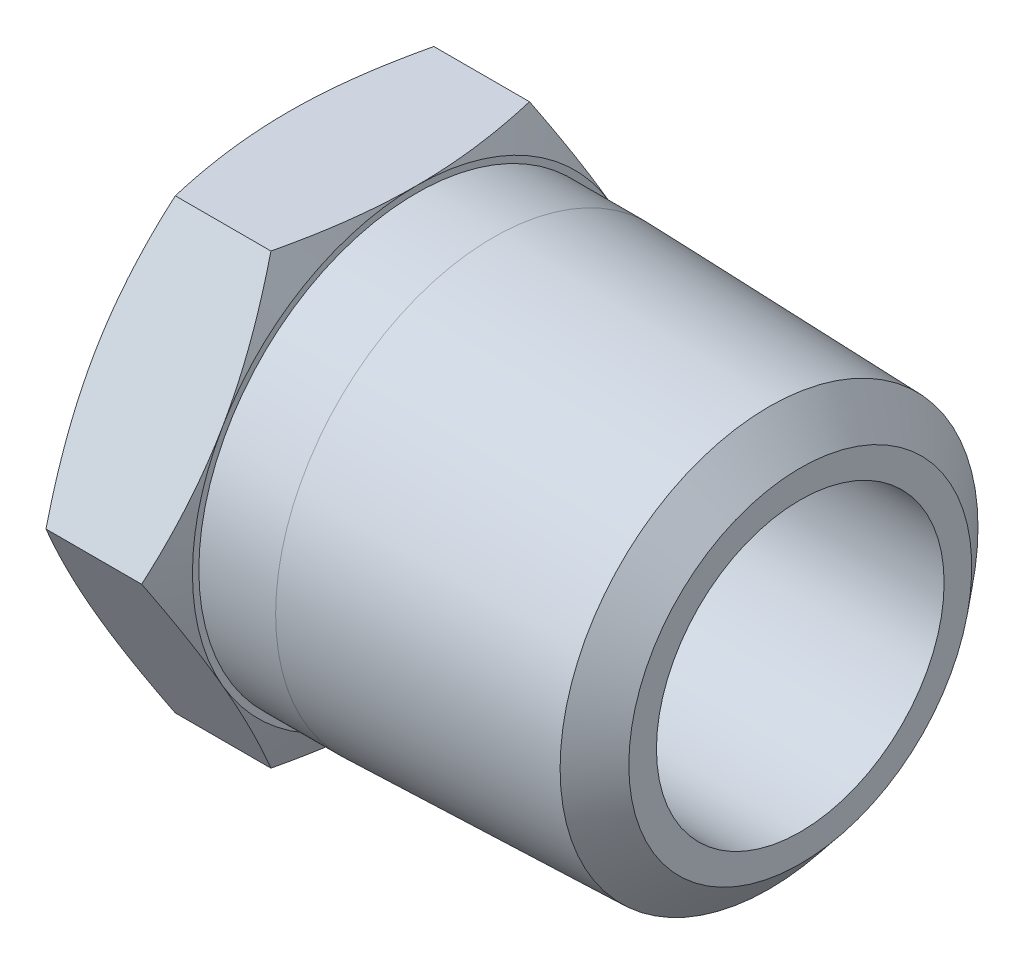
ISO-10303-21;
HEADER;
FILE_DESCRIPTION(('STEP AP214'),'2;1');
FILE_NAME('part.step','',(''),(''),'','','');
FILE_SCHEMA(('AUTOMOTIVE_DESIGN { 1 0 10303 214 1 1 1 1 }'));
ENDSEC;
DATA;
#1=APPLICATION_CONTEXT('core data for automotive mechanical design processes');
#2=APPLICATION_PROTOCOL_DEFINITION('international standard','automotive_design',2000,#1);
#3=PRODUCT_CONTEXT('',#1,'mechanical');
#4=PRODUCT('Part','Part','',(#3));
#5=PRODUCT_RELATED_PRODUCT_CATEGORY('part','',(#4));
#6=PRODUCT_DEFINITION_FORMATION('','',#4);
#7=PRODUCT_DEFINITION_CONTEXT('part definition',#1,'design');
#8=PRODUCT_DEFINITION('design','',#6,#7);
#9=PRODUCT_DEFINITION_SHAPE('','',#8);
#10=(LENGTH_UNIT() NAMED_UNIT(*) SI_UNIT(.MILLI.,.METRE.));
#11=(NAMED_UNIT(*) PLANE_ANGLE_UNIT() SI_UNIT($,.RADIAN.));
#12=(NAMED_UNIT(*) SI_UNIT($,.STERADIAN.) SOLID_ANGLE_UNIT());
#13=UNCERTAINTY_MEASURE_WITH_UNIT(LENGTH_MEASURE(1.E-05),#10,'distance_accuracy_value','');
#14=(GEOMETRIC_REPRESENTATION_CONTEXT(3) GLOBAL_UNCERTAINTY_ASSIGNED_CONTEXT((#13)) GLOBAL_UNIT_ASSIGNED_CONTEXT((#10,
#11,#12)) REPRESENTATION_CONTEXT('',''));
#15=CARTESIAN_POINT('',(0.,0.,0.));
#16=DIRECTION('',(0.,0.,1.));
#17=DIRECTION('',(1.,0.,0.));
#18=AXIS2_PLACEMENT_3D('',#15,#16,#17);
#19=CARTESIAN_POINT('',(-6.41405656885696E-10,0.,0.));
#20=DIRECTION('',(-1.,0.,0.));
#21=DIRECTION('',(0.,0.,1.));
#22=AXIS2_PLACEMENT_3D('',#19,#20,#21);
#23=CONICAL_SURFACE('',#22,8.88999999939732,0.816517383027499);
#24=CARTESIAN_POINT('',(1.29192563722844,0.,0.));
#25=DIRECTION('',(-1.,0.,0.));
#26=DIRECTION('',(0.,1.,0.));
#27=AXIS2_PLACEMENT_3D('',#24,#25,#26);
#28=CIRCLE('',#27,7.51505667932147);
#29=CARTESIAN_POINT('',(1.29192563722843,7.51505667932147,0.));
#30=VERTEX_POINT('',#29);
#31=EDGE_CURVE('E113',#30,#30,#28,.F.);
#32=ORIENTED_EDGE('',*,*,#31,.T.);
#33=EDGE_LOOP('',(#32));
#34=FACE_BOUND('',#33,.T.);
#35=CARTESIAN_POINT('',(-6.41405656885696E-10,0.,0.));
#36=DIRECTION('',(-1.,0.,0.));
#37=DIRECTION('',(0.,0.,1.));
#38=AXIS2_PLACEMENT_3D('',#35,#36,#37);
#39=CIRCLE('',#38,8.88999999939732);
#40=CARTESIAN_POINT('',(-6.41405656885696E-10,0.,8.88999999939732));
#41=VERTEX_POINT('',#40);
#42=EDGE_CURVE('E19',#41,#41,#39,.T.);
#43=ORIENTED_EDGE('',*,*,#42,.T.);
#44=EDGE_LOOP('',(#43));
#45=FACE_BOUND('',#44,.T.);
#46=ADVANCED_FACE('F15',(#34,#45),#23,.F.);
#47=CARTESIAN_POINT('',(0.,0.,0.));
#48=DIRECTION('',(1.,0.,0.));
#49=DIRECTION('',(0.,0.,-1.));
#50=AXIS2_PLACEMENT_3D('',#47,#48,#49);
#51=PLANE('',#50);
#52=ORIENTED_EDGE('',*,*,#42,.F.);
#53=EDGE_LOOP('',(#52));
#54=FACE_BOUND('',#53,.T.);
#55=CARTESIAN_POINT('',(-7.20264429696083E-09,0.,0.));
#56=DIRECTION('',(1.,0.,0.));
#57=DIRECTION('',(0.,0.,-1.));
#58=AXIS2_PLACEMENT_3D('',#55,#56,#57);
#59=CIRCLE('',#58,11.1125000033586);
#60=CARTESIAN_POINT('',(-7.98572902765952E-09,-5.55625000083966,-9.62370730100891));
#61=VERTEX_POINT('',#60);
#62=CARTESIAN_POINT('',(-7.98572823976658E-09,5.55625000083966,-9.62370730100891));
#63=VERTEX_POINT('',#62);
#64=EDGE_CURVE('E105',#61,#63,#59,.T.);
#65=ORIENTED_EDGE('',*,*,#64,.F.);
#66=CARTESIAN_POINT('',(-7.202645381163E-09,0.,0.));
#67=DIRECTION('',(1.,0.,0.));
#68=DIRECTION('',(0.,0.,-1.));
#69=AXIS2_PLACEMENT_3D('',#66,#67,#68);
#70=CIRCLE('',#69,11.1125000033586);
#71=CARTESIAN_POINT('',(-7.98572708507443E-09,-11.1125000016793,0.));
#72=VERTEX_POINT('',#71);
#73=EDGE_CURVE('E124',#72,#61,#70,.T.);
#74=ORIENTED_EDGE('',*,*,#73,.F.);
#75=CARTESIAN_POINT('',(-7.20264462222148E-09,0.,0.));
#76=DIRECTION('',(1.,0.,0.));
#77=DIRECTION('',(0.,0.,-1.));
#78=AXIS2_PLACEMENT_3D('',#75,#76,#77);
#79=CIRCLE('',#78,11.1125000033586);
#80=CARTESIAN_POINT('',(-7.98572747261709E-09,-5.55625000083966,9.62370730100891));
#81=VERTEX_POINT('',#80);
#82=EDGE_CURVE('E458',#81,#72,#79,.T.);
#83=ORIENTED_EDGE('',*,*,#82,.F.);
#84=CARTESIAN_POINT('',(-7.20264418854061E-09,0.,0.));
#85=DIRECTION('',(1.,0.,0.));
#86=DIRECTION('',(0.,0.,-1.));
#87=AXIS2_PLACEMENT_3D('',#84,#85,#86);
#88=CIRCLE('',#87,11.1125000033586);
#89=CARTESIAN_POINT('',(-7.98572381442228E-09,5.55625000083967,9.62370730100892));
#90=VERTEX_POINT('',#89);
#91=EDGE_CURVE('E459',#90,#81,#88,.T.);
#92=ORIENTED_EDGE('',*,*,#91,.F.);
#93=CARTESIAN_POINT('',(-7.20264548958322E-09,0.,0.));
#94=DIRECTION('',(1.,0.,0.));
#95=DIRECTION('',(0.,0.,-1.));
#96=AXIS2_PLACEMENT_3D('',#93,#94,#95);
#97=CIRCLE('',#96,11.1125000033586);
#98=CARTESIAN_POINT('',(-7.98572722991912E-09,11.1125000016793,0.));
#99=VERTEX_POINT('',#98);
#100=EDGE_CURVE('E108',#99,#90,#97,.T.);
#101=ORIENTED_EDGE('',*,*,#100,.F.);
#102=CARTESIAN_POINT('',(-7.20264462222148E-09,0.,0.));
#103=DIRECTION('',(1.,0.,0.));
#104=DIRECTION('',(0.,0.,-1.));
#105=AXIS2_PLACEMENT_3D('',#102,#103,#104);
#106=CIRCLE('',#105,11.1125000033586);
#107=EDGE_CURVE('E102',#63,#99,#106,.T.);
#108=ORIENTED_EDGE('',*,*,#107,.F.);
#109=EDGE_LOOP('',(#65,#74,#83,#92,#101,#108));
#110=FACE_BOUND('',#109,.T.);
#111=ADVANCED_FACE('F104',(#54,#110),#51,.F.);
#112=CARTESIAN_POINT('',(1.29192563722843,0.,0.));
#113=DIRECTION('',(-1.,0.,0.));
#114=DIRECTION('',(0.,0.,1.));
#115=AXIS2_PLACEMENT_3D('',#112,#113,#114);
#116=CONICAL_SURFACE('',#115,7.51505667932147,0.0311192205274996);
#117=CARTESIAN_POINT('',(10.16,0.,0.));
#118=DIRECTION('',(1.,0.,0.));
#119=DIRECTION('',(0.,0.,-1.));
#120=AXIS2_PLACEMENT_3D('',#117,#118,#119);
#121=CIRCLE('',#120,7.239);
#122=CARTESIAN_POINT('',(10.16,0.,-7.239));
#123=VERTEX_POINT('',#122);
#124=EDGE_CURVE('E123',#123,#123,#121,.T.);
#125=ORIENTED_EDGE('',*,*,#124,.T.);
#126=EDGE_LOOP('',(#125));
#127=FACE_BOUND('',#126,.T.);
#128=ORIENTED_EDGE('',*,*,#31,.F.);
#129=EDGE_LOOP('',(#128));
#130=FACE_BOUND('',#129,.T.);
#131=ADVANCED_FACE('F616',(#127,#130),#116,.F.);
#132=CARTESIAN_POINT('',(0.806443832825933,0.,0.));
#133=DIRECTION('',(1.,0.,0.));
#134=DIRECTION('',(0.,0.,-1.));
#135=AXIS2_PLACEMENT_3D('',#132,#133,#134);
#136=CONICAL_SURFACE('',#135,12.8419243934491,1.1344640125);
#137=ORIENTED_EDGE('',*,*,#107,.T.);
#138=CARTESIAN_POINT('',(0.80163402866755,11.1124999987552,-6.41580486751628));
#139=CARTESIAN_POINT('',(0.740258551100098,11.112499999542,-6.15253572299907));
#140=CARTESIAN_POINT('',(0.681560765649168,11.1124999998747,-5.88865023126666));
#141=CARTESIAN_POINT('',(0.570146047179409,11.1125000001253,-5.35956296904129));
#142=CARTESIAN_POINT('',(0.517430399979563,11.112500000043,-5.09436092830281));
#143=CARTESIAN_POINT('',(0.369582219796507,11.1124999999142,-4.29870236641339));
#144=CARTESIAN_POINT('',(0.284305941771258,11.1124999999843,-3.76633360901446));
#145=CARTESIAN_POINT('',(0.179888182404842,11.1125000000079,-2.96456290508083));
#146=CARTESIAN_POINT('',(0.148990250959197,11.1125000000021,-2.69665532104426));
#147=CARTESIAN_POINT('',(0.0955671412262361,11.1124999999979,-2.15999788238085));
#148=CARTESIAN_POINT('',(0.0730418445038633,11.1124999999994,-1.89124803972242));
#149=CARTESIAN_POINT('',(0.0367411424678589,11.1125000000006,-1.35225459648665));
#150=CARTESIAN_POINT('',(0.022995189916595,11.1125000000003,-1.08200900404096));
#151=CARTESIAN_POINT('',(0.00460803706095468,11.1124999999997,-0.541178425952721));
#152=CARTESIAN_POINT('',(-3.21164294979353E-05,11.1124999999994,-0.270593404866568));
#153=CARTESIAN_POINT('',(-8.76880886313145E-09,11.1125,-1.70391558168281E-10));
#154=B_SPLINE_CURVE_WITH_KNOTS('',3,(#138,#139,#140,#141,#142,#143,#144,#145,#146,#147,#148,
#149,#150,#151,#152,#153),.UNSPECIFIED.,.F.,.F.,(4,2,2,2,2,2,2,4),(0.,0.810948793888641,
1.62207156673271,3.23858729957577,4.04753231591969,4.85646588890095,5.66809919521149,
6.47982580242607),.UNSPECIFIED.);
#155=CARTESIAN_POINT('',(0.801634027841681,11.1125000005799,-6.41580486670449));
#156=VERTEX_POINT('',#155);
#157=EDGE_CURVE('E129',#156,#99,#154,.T.);
#158=ORIENTED_EDGE('',*,*,#157,.F.);
#159=CARTESIAN_POINT('',(-8.03799961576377E-09,5.55624999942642,-9.62370729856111));
#160=CARTESIAN_POINT('',(-3.21161692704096E-05,5.79059076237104,-9.48841059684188));
#161=CARTESIAN_POINT('',(0.00460803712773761,6.02492426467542,-9.35311808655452));
#162=CARTESIAN_POINT('',(0.02299518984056,6.49329728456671,-9.082702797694));
#163=CARTESIAN_POINT('',(0.0367411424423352,6.7273368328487,-8.94758000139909));
#164=CARTESIAN_POINT('',(0.0730418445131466,7.19411884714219,-8.67808327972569));
#165=CARTESIAN_POINT('',(0.0955671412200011,7.42686303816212,-8.54370835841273));
#166=CARTESIAN_POINT('',(0.148990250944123,7.89162201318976,-8.27537963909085));
#167=CARTESIAN_POINT('',(0.179888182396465,8.12363678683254,-8.14142584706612));
#168=CARTESIAN_POINT('',(0.284305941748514,8.81799058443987,-7.74054049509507));
#169=CARTESIAN_POINT('',(0.36958221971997,9.27903545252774,-7.47435611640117));
#170=CARTESIAN_POINT('',(0.517430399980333,9.96809597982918,-7.07652683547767));
#171=CARTESIAN_POINT('',(0.570146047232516,10.1977676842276,-6.94392581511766));
#172=CARTESIAN_POINT('',(0.681560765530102,10.6559706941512,-6.67938218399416));
#173=CARTESIAN_POINT('',(0.740258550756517,10.8845022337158,-6.54743943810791));
#174=CARTESIAN_POINT('',(0.801634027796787,11.112500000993,-6.41580486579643));
#175=B_SPLINE_CURVE_WITH_KNOTS('',3,(#159,#160,#161,#162,#163,#164,#165,#166,#167,#168,#169,
#170,#171,#172,#173,#174),.UNSPECIFIED.,.F.,.F.,(4,2,2,2,2,2,2,4),(0.,0.811726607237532,
1.62335991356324,2.43229348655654,3.2412385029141,4.85775423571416,5.66887700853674,
6.4798258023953),.UNSPECIFIED.);
#176=EDGE_CURVE('E126',#63,#156,#175,.T.);
#177=ORIENTED_EDGE('',*,*,#176,.F.);
#178=EDGE_LOOP('',(#137,#158,#177));
#179=FACE_BOUND('',#178,.T.);
#180=ADVANCED_FACE('F127',(#179),#136,.T.);
#181=CARTESIAN_POINT('',(0.806443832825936,0.,0.));
#182=DIRECTION('',(1.,0.,0.));
#183=DIRECTION('',(0.,0.,-1.));
#184=AXIS2_PLACEMENT_3D('',#181,#182,#183);
#185=CONICAL_SURFACE('',#184,12.8419243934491,1.1344640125);
#186=CARTESIAN_POINT('',(-8.03799388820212E-09,11.1124999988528,0.));
#187=CARTESIAN_POINT('',(-3.21161692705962E-05,11.1124999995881,0.270593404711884));
#188=CARTESIAN_POINT('',(0.00460803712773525,11.1124999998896,0.541178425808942));
#189=CARTESIAN_POINT('',(0.0229951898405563,11.1125000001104,1.08200900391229));
#190=CARTESIAN_POINT('',(0.0367411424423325,11.1125000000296,1.35225459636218));
#191=CARTESIAN_POINT('',(0.0730418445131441,11.1124999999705,1.89124803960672));
#192=CARTESIAN_POINT('',(0.095567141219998,11.1124999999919,2.15999788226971));
#193=CARTESIAN_POINT('',(0.14899025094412,11.1125000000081,2.69665532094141));
#194=CARTESIAN_POINT('',(0.179888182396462,11.1125000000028,2.96456290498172));
#195=CARTESIAN_POINT('',(0.284305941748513,11.1124999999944,3.76633360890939));
#196=CARTESIAN_POINT('',(0.369582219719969,11.1124999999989,4.29870236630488));
#197=CARTESIAN_POINT('',(0.517430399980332,11.1125000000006,5.09436092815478));
#198=CARTESIAN_POINT('',(0.570146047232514,11.1125000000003,5.35956296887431));
#199=CARTESIAN_POINT('',(0.681560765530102,11.1124999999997,5.88865023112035));
#200=CARTESIAN_POINT('',(0.740258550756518,11.1124999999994,6.15253572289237));
#201=CARTESIAN_POINT('',(0.801634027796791,11.1125,6.4158048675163));
#202=B_SPLINE_CURVE_WITH_KNOTS('',3,(#186,#187,#188,#189,#190,#191,#192,#193,#194,#195,#196,
#197,#198,#199,#200,#201),.UNSPECIFIED.,.F.,.F.,(4,2,2,2,2,2,2,4),(0.,0.811726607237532,
1.62335991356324,2.43229348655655,3.24123850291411,4.85775423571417,5.66887700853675,
6.47982580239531),.UNSPECIFIED.);
#203=CARTESIAN_POINT('',(0.801634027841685,11.1125000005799,6.41580486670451));
#204=VERTEX_POINT('',#203);
#205=EDGE_CURVE('E300',#99,#204,#202,.T.);
#206=ORIENTED_EDGE('',*,*,#205,.F.);
#207=ORIENTED_EDGE('',*,*,#100,.T.);
#208=CARTESIAN_POINT('',(0.801634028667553,11.1125000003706,6.41580486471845));
#209=CARTESIAN_POINT('',(0.740258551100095,10.8845022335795,6.54743943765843));
#210=CARTESIAN_POINT('',(0.681560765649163,10.6559706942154,6.67938218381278));
#211=CARTESIAN_POINT('',(0.570146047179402,10.1977676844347,6.94392581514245));
#212=CARTESIAN_POINT('',(0.517430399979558,9.96809597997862,7.07652683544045));
#213=CARTESIAN_POINT('',(0.369582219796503,9.2790354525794,7.47435611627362));
#214=CARTESIAN_POINT('',(0.284305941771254,8.81799058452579,7.74054049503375));
#215=CARTESIAN_POINT('',(0.179888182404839,8.12363678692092,8.14142584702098));
#216=CARTESIAN_POINT('',(0.148990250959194,7.89162201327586,8.27537963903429));
#217=CARTESIAN_POINT('',(0.0955671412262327,7.42686303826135,8.54370835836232));
#218=CARTESIAN_POINT('',(0.07304184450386,7.19411884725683,8.67808327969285));
#219=CARTESIAN_POINT('',(0.0367411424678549,6.72733683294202,8.94758000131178));
#220=CARTESIAN_POINT('',(0.0229951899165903,6.49329728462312,9.08270279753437));
#221=CARTESIAN_POINT('',(0.00460803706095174,6.02492426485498,9.35311808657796));
#222=CARTESIAN_POINT('',(-3.21164294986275E-05,5.79059076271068,9.48841059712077));
#223=CARTESIAN_POINT('',(-8.76880421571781E-09,5.55625000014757,9.62370729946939));
#224=B_SPLINE_CURVE_WITH_KNOTS('',3,(#208,#209,#210,#211,#212,#213,#214,#215,#216,#217,#218,
#219,#220,#221,#222,#223),.UNSPECIFIED.,.F.,.F.,(4,2,2,2,2,2,2,4),(0.,0.81094879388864,
1.6220715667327,3.23858729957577,4.04753231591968,4.85646588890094,5.66809919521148,
6.47982580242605),.UNSPECIFIED.);
#225=EDGE_CURVE('E293',#204,#90,#224,.T.);
#226=ORIENTED_EDGE('',*,*,#225,.F.);
#227=EDGE_LOOP('',(#206,#207,#226));
#228=FACE_BOUND('',#227,.T.);
#229=ADVANCED_FACE('F283',(#228),#185,.T.);
#230=CARTESIAN_POINT('',(0.806443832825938,0.,0.));
#231=DIRECTION('',(1.,0.,0.));
#232=DIRECTION('',(0.,0.,-1.));
#233=AXIS2_PLACEMENT_3D('',#230,#231,#232);
#234=CONICAL_SURFACE('',#233,12.8419243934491,1.1344640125);
#235=CARTESIAN_POINT('',(-8.03798870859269E-09,5.55624999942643,9.62370729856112));
#236=CARTESIAN_POINT('',(-3.21161692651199E-05,5.32190923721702,9.75900400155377));
#237=CARTESIAN_POINT('',(0.0046080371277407,5.0875757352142,9.89429651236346));
#238=CARTESIAN_POINT('',(0.0229951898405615,4.61920271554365,10.1647118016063));
#239=CARTESIAN_POINT('',(0.0367411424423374,4.38516316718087,10.2998345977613));
#240=CARTESIAN_POINT('',(0.0730418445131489,3.91838115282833,10.5693313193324));
#241=CARTESIAN_POINT('',(0.095567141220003,3.68563696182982,10.7037062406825));
#242=CARTESIAN_POINT('',(0.148990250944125,3.2208779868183,10.9720349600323));
#243=CARTESIAN_POINT('',(0.179888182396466,2.98886321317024,11.1059887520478));
#244=CARTESIAN_POINT('',(0.284305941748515,2.29450941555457,11.5068741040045));
#245=CARTESIAN_POINT('',(0.369582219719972,1.83346454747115,11.7730584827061));
#246=CARTESIAN_POINT('',(0.517430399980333,1.14440402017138,12.1708877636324));
#247=CARTESIAN_POINT('',(0.570146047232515,0.914732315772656,12.303488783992));
#248=CARTESIAN_POINT('',(0.681560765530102,0.456529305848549,12.5680324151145));
#249=CARTESIAN_POINT('',(0.740258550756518,0.227997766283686,12.6999751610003));
#250=CARTESIAN_POINT('',(0.801634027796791,-9.9295255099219E-10,12.8316097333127));
#251=B_SPLINE_CURVE_WITH_KNOTS('',3,(#235,#236,#237,#238,#239,#240,#241,#242,#243,#244,#245,
#246,#247,#248,#249,#250),.UNSPECIFIED.,.F.,.F.,(4,2,2,2,2,2,2,4),(0.,0.81172660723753,
1.62335991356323,2.43229348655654,3.2412385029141,4.85775423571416,5.66887700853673,
6.47982580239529),.UNSPECIFIED.);
#252=CARTESIAN_POINT('',(0.801634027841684,0.,12.831609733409));
#253=VERTEX_POINT('',#252);
#254=EDGE_CURVE('E287',#90,#253,#251,.T.);
#255=ORIENTED_EDGE('',*,*,#254,.F.);
#256=ORIENTED_EDGE('',*,*,#91,.T.);
#257=CARTESIAN_POINT('',(0.80163402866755,1.61533744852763E-09,12.8316097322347));
#258=CARTESIAN_POINT('',(0.740258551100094,-0.227997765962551,12.6999751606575));
#259=CARTESIAN_POINT('',(0.681560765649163,-0.456529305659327,12.5680324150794));
#260=CARTESIAN_POINT('',(0.570146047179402,-0.914732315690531,12.3034887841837));
#261=CARTESIAN_POINT('',(0.517430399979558,-1.1444040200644,12.1708877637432));
#262=CARTESIAN_POINT('',(0.369582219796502,-1.83346454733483,11.773058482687));
#263=CARTESIAN_POINT('',(0.284305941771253,-2.29450941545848,11.5068741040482));
#264=CARTESIAN_POINT('',(0.179888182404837,-2.98886321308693,11.1059887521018));
#265=CARTESIAN_POINT('',(0.148990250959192,-3.22087798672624,10.9720349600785));
#266=CARTESIAN_POINT('',(0.0955671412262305,-3.68563696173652,10.7037062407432));
#267=CARTESIAN_POINT('',(0.0730418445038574,-3.91838115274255,10.5693313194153));
#268=CARTESIAN_POINT('',(0.0367411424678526,-4.38516316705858,10.2998345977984));
#269=CARTESIAN_POINT('',(0.0229951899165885,-4.61920271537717,10.1647118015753));
#270=CARTESIAN_POINT('',(0.00460803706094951,-5.08757573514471,9.89429651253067));
#271=CARTESIAN_POINT('',(-3.21164295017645E-05,-5.32190923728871,9.75900400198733));
#272=CARTESIAN_POINT('',(-8.76880999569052E-09,-5.55624999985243,9.62370729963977));
#273=B_SPLINE_CURVE_WITH_KNOTS('',3,(#257,#258,#259,#260,#261,#262,#263,#264,#265,#266,#267,
#268,#269,#270,#271,#272),.UNSPECIFIED.,.F.,.F.,(4,2,2,2,2,2,2,4),(0.,0.810948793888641,
1.62207156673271,3.23858729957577,4.04753231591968,4.85646588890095,5.66809919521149,
6.47982580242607),.UNSPECIFIED.);
#274=EDGE_CURVE('E264',#253,#81,#273,.T.);
#275=ORIENTED_EDGE('',*,*,#274,.F.);
#276=EDGE_LOOP('',(#255,#256,#275));
#277=FACE_BOUND('',#276,.T.);
#278=ADVANCED_FACE('F277',(#277),#234,.T.);
#279=CARTESIAN_POINT('',(0.806443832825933,0.,0.));
#280=DIRECTION('',(1.,0.,0.));
#281=DIRECTION('',(0.,0.,-1.));
#282=AXIS2_PLACEMENT_3D('',#279,#280,#281);
#283=CONICAL_SURFACE('',#282,12.8419243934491,1.1344640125);
#284=CARTESIAN_POINT('',(-8.03799821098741E-09,-5.55624999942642,9.62370729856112));
#285=CARTESIAN_POINT('',(-3.21161692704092E-05,-5.79059076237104,9.48841059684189));
#286=CARTESIAN_POINT('',(0.00460803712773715,-6.02492426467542,9.35311808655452));
#287=CARTESIAN_POINT('',(0.0229951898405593,-6.4932972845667,9.082702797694));
#288=CARTESIAN_POINT('',(0.0367411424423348,-6.72733683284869,8.94758000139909));
#289=CARTESIAN_POINT('',(0.0730418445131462,-7.19411884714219,8.67808327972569));
#290=CARTESIAN_POINT('',(0.0955671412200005,-7.42686303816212,8.54370835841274));
#291=CARTESIAN_POINT('',(0.148990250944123,-7.89162201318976,8.27537963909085));
#292=CARTESIAN_POINT('',(0.179888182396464,-8.12363678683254,8.14142584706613));
#293=CARTESIAN_POINT('',(0.284305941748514,-8.81799058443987,7.74054049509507));
#294=CARTESIAN_POINT('',(0.36958221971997,-9.27903545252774,7.47435611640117));
#295=CARTESIAN_POINT('',(0.517430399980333,-9.96809597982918,7.07652683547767));
#296=CARTESIAN_POINT('',(0.570146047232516,-10.1977676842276,6.94392581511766));
#297=CARTESIAN_POINT('',(0.681560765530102,-10.6559706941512,6.67938218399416));
#298=CARTESIAN_POINT('',(0.740258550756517,-10.8845022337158,6.54743943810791));
#299=CARTESIAN_POINT('',(0.801634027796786,-11.112500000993,6.41580486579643));
#300=B_SPLINE_CURVE_WITH_KNOTS('',3,(#284,#285,#286,#287,#288,#289,#290,#291,#292,#293,#294,
#295,#296,#297,#298,#299),.UNSPECIFIED.,.F.,.F.,(4,2,2,2,2,2,2,4),(0.,0.811726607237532,
1.62335991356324,2.43229348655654,3.24123850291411,4.85775423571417,5.66887700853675,
6.4798258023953),.UNSPECIFIED.);
#301=CARTESIAN_POINT('',(0.801634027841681,-11.1125000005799,6.41580486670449));
#302=VERTEX_POINT('',#301);
#303=EDGE_CURVE('E258',#81,#302,#300,.T.);
#304=ORIENTED_EDGE('',*,*,#303,.F.);
#305=ORIENTED_EDGE('',*,*,#82,.T.);
#306=CARTESIAN_POINT('',(0.80163402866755,-11.1124999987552,6.41580486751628));
#307=CARTESIAN_POINT('',(0.740258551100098,-11.112499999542,6.15253572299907));
#308=CARTESIAN_POINT('',(0.681560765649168,-11.1124999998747,5.88865023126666));
#309=CARTESIAN_POINT('',(0.570146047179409,-11.1125000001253,5.35956296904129));
#310=CARTESIAN_POINT('',(0.517430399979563,-11.112500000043,5.09436092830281));
#311=CARTESIAN_POINT('',(0.369582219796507,-11.1124999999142,4.29870236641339));
#312=CARTESIAN_POINT('',(0.284305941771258,-11.1124999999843,3.76633360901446));
#313=CARTESIAN_POINT('',(0.179888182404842,-11.1125000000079,2.96456290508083));
#314=CARTESIAN_POINT('',(0.148990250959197,-11.1125000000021,2.69665532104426));
#315=CARTESIAN_POINT('',(0.0955671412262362,-11.1124999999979,2.15999788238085));
#316=CARTESIAN_POINT('',(0.0730418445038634,-11.1124999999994,1.89124803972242));
#317=CARTESIAN_POINT('',(0.036741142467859,-11.1125000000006,1.35225459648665));
#318=CARTESIAN_POINT('',(0.022995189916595,-11.1125000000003,1.08200900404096));
#319=CARTESIAN_POINT('',(0.00460803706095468,-11.1124999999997,0.541178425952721));
#320=CARTESIAN_POINT('',(-3.21164294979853E-05,-11.1124999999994,0.270593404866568));
#321=CARTESIAN_POINT('',(-8.76880897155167E-09,-11.1125,1.70391558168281E-10));
#322=B_SPLINE_CURVE_WITH_KNOTS('',3,(#306,#307,#308,#309,#310,#311,#312,#313,#314,#315,#316,
#317,#318,#319,#320,#321),.UNSPECIFIED.,.F.,.F.,(4,2,2,2,2,2,2,4),(0.,0.810948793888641,
1.62207156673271,3.23858729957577,4.04753231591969,4.85646588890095,5.66809919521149,
6.47982580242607),.UNSPECIFIED.);
#323=EDGE_CURVE('E265',#302,#72,#322,.T.);
#324=ORIENTED_EDGE('',*,*,#323,.F.);
#325=EDGE_LOOP('',(#304,#305,#324));
#326=FACE_BOUND('',#325,.T.);
#327=ADVANCED_FACE('F274',(#326),#283,.T.);
#328=CARTESIAN_POINT('',(0.806443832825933,0.,0.));
#329=DIRECTION('',(1.,0.,0.));
#330=DIRECTION('',(0.,0.,-1.));
#331=AXIS2_PLACEMENT_3D('',#328,#329,#330);
#332=CONICAL_SURFACE('',#331,12.8419243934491,1.1344640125);
#333=ORIENTED_EDGE('',*,*,#73,.T.);
#334=CARTESIAN_POINT('',(0.80163402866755,-11.1125000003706,-6.41580486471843));
#335=CARTESIAN_POINT('',(0.740258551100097,-10.8845022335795,-6.54743943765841));
#336=CARTESIAN_POINT('',(0.681560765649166,-10.6559706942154,-6.67938218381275));
#337=CARTESIAN_POINT('',(0.570146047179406,-10.1977676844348,-6.94392581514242));
#338=CARTESIAN_POINT('',(0.517430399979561,-9.96809597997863,-7.07652683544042));
#339=CARTESIAN_POINT('',(0.369582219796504,-9.27903545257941,-7.4743561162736));
#340=CARTESIAN_POINT('',(0.284305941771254,-8.8179905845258,-7.74054049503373));
#341=CARTESIAN_POINT('',(0.179888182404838,-8.12363678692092,-8.14142584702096));
#342=CARTESIAN_POINT('',(0.148990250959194,-7.89162201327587,-8.27537963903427));
#343=CARTESIAN_POINT('',(0.0955671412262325,-7.42686303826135,-8.5437083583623));
#344=CARTESIAN_POINT('',(0.0730418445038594,-7.19411884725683,-8.67808327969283));
#345=CARTESIAN_POINT('',(0.0367411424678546,-6.72733683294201,-8.94758000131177));
#346=CARTESIAN_POINT('',(0.0229951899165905,-6.49329728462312,-9.08270279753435));
#347=CARTESIAN_POINT('',(0.0046080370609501,-6.02492426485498,-9.35311808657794));
#348=CARTESIAN_POINT('',(-3.21164295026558E-05,-5.79059076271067,-9.48841059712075));
#349=CARTESIAN_POINT('',(-8.76881400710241E-09,-5.55625000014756,-9.62370729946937));
#350=B_SPLINE_CURVE_WITH_KNOTS('',3,(#334,#335,#336,#337,#338,#339,#340,#341,#342,#343,#344,
#345,#346,#347,#348,#349),.UNSPECIFIED.,.F.,.F.,(4,2,2,2,2,2,2,4),(0.,0.810948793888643,
1.62207156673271,3.23858729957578,4.04753231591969,4.85646588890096,5.6680991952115,
6.47982580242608),.UNSPECIFIED.);
#351=CARTESIAN_POINT('',(0.80163402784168,-11.1125000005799,-6.41580486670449));
#352=VERTEX_POINT('',#351);
#353=EDGE_CURVE('E168',#352,#61,#350,.T.);
#354=ORIENTED_EDGE('',*,*,#353,.F.);
#355=CARTESIAN_POINT('',(-8.03799394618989E-09,-11.1124999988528,0.));
#356=CARTESIAN_POINT('',(-3.21161692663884E-05,-11.1124999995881,-0.270593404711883));
#357=CARTESIAN_POINT('',(0.00460803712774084,-11.1124999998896,-0.54117842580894));
#358=CARTESIAN_POINT('',(0.0229951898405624,-11.1125000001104,-1.08200900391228));
#359=CARTESIAN_POINT('',(0.0367411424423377,-11.1125000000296,-1.35225459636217));
#360=CARTESIAN_POINT('',(0.0730418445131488,-11.1124999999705,-1.89124803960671));
#361=CARTESIAN_POINT('',(0.0955671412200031,-11.1124999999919,-2.1599978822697));
#362=CARTESIAN_POINT('',(0.148990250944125,-11.1125000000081,-2.6966553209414));
#363=CARTESIAN_POINT('',(0.179888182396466,-11.1125000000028,-2.9645629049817));
#364=CARTESIAN_POINT('',(0.284305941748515,-11.1124999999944,-3.76633360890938));
#365=CARTESIAN_POINT('',(0.369582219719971,-11.1124999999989,-4.29870236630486));
#366=CARTESIAN_POINT('',(0.517430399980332,-11.1125000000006,-5.09436092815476));
#367=CARTESIAN_POINT('',(0.570146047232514,-11.1125000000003,-5.35956296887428));
#368=CARTESIAN_POINT('',(0.6815607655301,-11.1124999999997,-5.88865023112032));
#369=CARTESIAN_POINT('',(0.740258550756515,-11.1124999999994,-6.15253572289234));
#370=CARTESIAN_POINT('',(0.801634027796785,-11.1125,-6.41580486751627));
#371=B_SPLINE_CURVE_WITH_KNOTS('',3,(#355,#356,#357,#358,#359,#360,#361,#362,#363,#364,#365,
#366,#367,#368,#369,#370),.UNSPECIFIED.,.F.,.F.,(4,2,2,2,2,2,2,4),(0.,0.811726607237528,
1.62335991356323,2.43229348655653,3.24123850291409,4.85775423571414,5.66887700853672,
6.47982580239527),.UNSPECIFIED.);
#372=EDGE_CURVE('E371',#72,#352,#371,.T.);
#373=ORIENTED_EDGE('',*,*,#372,.F.);
#374=EDGE_LOOP('',(#333,#354,#373));
#375=FACE_BOUND('',#374,.T.);
#376=ADVANCED_FACE('F157',(#375),#332,.T.);
#377=CARTESIAN_POINT('',(0.806443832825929,0.,0.));
#378=DIRECTION('',(1.,0.,0.));
#379=DIRECTION('',(0.,0.,-1.));
#380=AXIS2_PLACEMENT_3D('',#377,#378,#379);
#381=CONICAL_SURFACE('',#380,12.8419243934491,1.1344640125);
#382=ORIENTED_EDGE('',*,*,#64,.T.);
#383=CARTESIAN_POINT('',(0.801634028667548,-1.61533768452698E-09,-12.8316097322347));
#384=CARTESIAN_POINT('',(0.740258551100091,0.227997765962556,-12.6999751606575));
#385=CARTESIAN_POINT('',(0.68156076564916,0.456529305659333,-12.5680324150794));
#386=CARTESIAN_POINT('',(0.570146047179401,0.914732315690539,-12.3034887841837));
#387=CARTESIAN_POINT('',(0.517430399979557,1.1444040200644,-12.1708877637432));
#388=CARTESIAN_POINT('',(0.369582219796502,1.83346454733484,-11.773058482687));
#389=CARTESIAN_POINT('',(0.284305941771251,2.29450941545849,-11.5068741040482));
#390=CARTESIAN_POINT('',(0.179888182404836,2.98886321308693,-11.1059887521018));
#391=CARTESIAN_POINT('',(0.148990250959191,3.22087798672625,-10.9720349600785));
#392=CARTESIAN_POINT('',(0.0955671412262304,3.68563696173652,-10.7037062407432));
#393=CARTESIAN_POINT('',(0.073041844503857,3.91838115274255,-10.5693313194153));
#394=CARTESIAN_POINT('',(0.0367411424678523,4.38516316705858,-10.2998345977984));
#395=CARTESIAN_POINT('',(0.0229951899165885,4.61920271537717,-10.1647118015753));
#396=CARTESIAN_POINT('',(0.00460803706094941,5.08757573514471,-9.89429651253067));
#397=CARTESIAN_POINT('',(-3.21164295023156E-05,5.32190923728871,-9.75900400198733));
#398=CARTESIAN_POINT('',(-8.76881212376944E-09,5.55624999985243,-9.62370729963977));
#399=B_SPLINE_CURVE_WITH_KNOTS('',3,(#383,#384,#385,#386,#387,#388,#389,#390,#391,#392,#393,
#394,#395,#396,#397,#398),.UNSPECIFIED.,.F.,.F.,(4,2,2,2,2,2,2,4),(0.,0.81094879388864,
1.6220715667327,3.23858729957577,4.04753231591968,4.85646588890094,5.66809919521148,
6.47982580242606),.UNSPECIFIED.);
#400=CARTESIAN_POINT('',(0.801634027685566,-5.79856724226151E-10,-12.8316097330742));
#401=VERTEX_POINT('',#400);
#402=EDGE_CURVE('E118',#401,#63,#399,.T.);
#403=ORIENTED_EDGE('',*,*,#402,.F.);
#404=CARTESIAN_POINT('',(-8.03800242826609E-09,-5.55624999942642,-9.62370729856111));
#405=CARTESIAN_POINT('',(-3.21161692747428E-05,-5.32190923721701,-9.75900400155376));
#406=CARTESIAN_POINT('',(0.00460803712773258,-5.08757573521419,-9.89429651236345));
#407=CARTESIAN_POINT('',(0.0229951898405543,-4.61920271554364,-10.1647118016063));
#408=CARTESIAN_POINT('',(0.0367411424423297,-4.38516316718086,-10.2998345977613));
#409=CARTESIAN_POINT('',(0.073041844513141,-3.91838115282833,-10.5693313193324));
#410=CARTESIAN_POINT('',(0.0955671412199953,-3.68563696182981,-10.7037062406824));
#411=CARTESIAN_POINT('',(0.148990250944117,-3.22087798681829,-10.9720349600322));
#412=CARTESIAN_POINT('',(0.179888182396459,-2.98886321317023,-11.1059887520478));
#413=CARTESIAN_POINT('',(0.284305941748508,-2.29450941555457,-11.5068741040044));
#414=CARTESIAN_POINT('',(0.369582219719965,-1.83346454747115,-11.773058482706));
#415=CARTESIAN_POINT('',(0.517430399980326,-1.14440402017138,-12.1708877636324));
#416=CARTESIAN_POINT('',(0.570146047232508,-0.914732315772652,-12.303488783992));
#417=CARTESIAN_POINT('',(0.681560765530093,-0.456529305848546,-12.5680324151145));
#418=CARTESIAN_POINT('',(0.740258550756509,-0.227997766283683,-12.6999751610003));
#419=CARTESIAN_POINT('',(0.801634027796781,9.92957036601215E-10,-12.8316097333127));
#420=B_SPLINE_CURVE_WITH_KNOTS('',3,(#404,#405,#406,#407,#408,#409,#410,#411,#412,#413,#414,
#415,#416,#417,#418,#419),.UNSPECIFIED.,.F.,.F.,(4,2,2,2,2,2,2,4),(0.,0.811726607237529,
1.62335991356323,2.43229348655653,3.24123850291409,4.85775423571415,5.66887700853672,
6.47982580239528),.UNSPECIFIED.);
#421=EDGE_CURVE('E121',#61,#401,#420,.T.);
#422=ORIENTED_EDGE('',*,*,#421,.F.);
#423=EDGE_LOOP('',(#382,#403,#422));
#424=FACE_BOUND('',#423,.T.);
#425=ADVANCED_FACE('F116',(#424),#381,.T.);
#426=CARTESIAN_POINT('',(10.16,0.,0.));
#427=DIRECTION('',(1.,0.,0.));
#428=DIRECTION('',(0.,0.,-1.));
#429=AXIS2_PLACEMENT_3D('',#426,#427,#428);
#430=CYLINDRICAL_SURFACE('',#429,7.239);
#431=ORIENTED_EDGE('',*,*,#124,.F.);
#432=EDGE_LOOP('',(#431));
#433=FACE_BOUND('',#432,.T.);
#434=CARTESIAN_POINT('',(14.224,0.,0.));
#435=DIRECTION('',(1.,0.,0.));
#436=DIRECTION('',(0.,0.,-1.));
#437=AXIS2_PLACEMENT_3D('',#434,#435,#436);
#438=CIRCLE('',#437,7.239);
#439=CARTESIAN_POINT('',(14.224,0.,-7.239));
#440=VERTEX_POINT('',#439);
#441=EDGE_CURVE('E169',#440,#440,#438,.T.);
#442=ORIENTED_EDGE('',*,*,#441,.T.);
#443=EDGE_LOOP('',(#442));
#444=FACE_BOUND('',#443,.T.);
#445=ADVANCED_FACE('F156',(#433,#444),#430,.F.);
#446=CARTESIAN_POINT('',(0.,11.1125,-6.41580486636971));
#447=DIRECTION('',(0.,0.5,-0.866025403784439));
#448=DIRECTION('',(0.,0.866025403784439,0.5));
#449=AXIS2_PLACEMENT_3D('',#446,#447,#448);
#450=PLANE('',#449);
#451=ORIENTED_EDGE('',*,*,#176,.T.);
#452=DIRECTION('',(1.,0.,0.));
#453=VECTOR('',#452,1.);
#454=CARTESIAN_POINT('',(0.,11.1125,-6.41580486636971));
#455=LINE('',#454,#453);
#456=CARTESIAN_POINT('',(5.54836598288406,11.1125,-6.41580482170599));
#457=VERTEX_POINT('',#456);
#458=EDGE_CURVE('E132',#457,#156,#455,.F.);
#459=ORIENTED_EDGE('',*,*,#458,.F.);
#460=CARTESIAN_POINT('',(6.350000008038,5.55624999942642,-9.62370729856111));
#461=CARTESIAN_POINT('',(6.35003211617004,5.7905907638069,-9.48841059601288));
#462=CARTESIAN_POINT('',(6.3453919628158,6.02492426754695,-9.35311808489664));
#463=CARTESIAN_POINT('',(6.32700480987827,6.49329729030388,-9.08270279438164));
#464=CARTESIAN_POINT('',(6.31325885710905,6.72733684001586,-8.94757999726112));
#465=CARTESIAN_POINT('',(6.27695815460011,7.19411885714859,-8.67808327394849));
#466=CARTESIAN_POINT('',(6.25443285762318,7.4268630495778,-8.54370835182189));
#467=CARTESIAN_POINT('',(6.20100974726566,7.89162202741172,-8.2753796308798));
#468=CARTESIAN_POINT('',(6.17011181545,8.1236368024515,-8.14142583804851));
#469=CARTESIAN_POINT('',(6.06569405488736,8.81799060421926,-7.74054048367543));
#470=CARTESIAN_POINT('',(5.98041777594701,9.27903547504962,-7.47435610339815));
#471=CARTESIAN_POINT('',(5.83256959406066,9.96809600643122,-7.07652682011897));
#472=CARTESIAN_POINT('',(5.77985394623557,10.1977677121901,-6.94392579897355));
#473=CARTESIAN_POINT('',(5.66843922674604,10.6559707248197,-6.67938216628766));
#474=CARTESIAN_POINT('',(5.60974144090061,10.88450226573,-6.54743941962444));
#475=CARTESIAN_POINT('',(5.54836596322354,11.112500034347,-6.41580484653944));
#476=B_SPLINE_CURVE_WITH_KNOTS('',3,(#460,#461,#462,#463,#464,#465,#466,#467,#468,#469,#470,
#471,#472,#473,#474,#475),.UNSPECIFIED.,.F.,.F.,(4,2,2,2,2,2,2,4),(0.,0.81172661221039,
1.62335992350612,2.43229350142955,3.24123852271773,4.8577542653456,5.66887704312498,
6.4798258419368),.UNSPECIFIED.);
#477=CARTESIAN_POINT('',(6.35000000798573,5.55625000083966,-9.62370730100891));
#478=VERTEX_POINT('',#477);
#479=EDGE_CURVE('E344',#478,#457,#476,.T.);
#480=ORIENTED_EDGE('',*,*,#479,.F.);
#481=CARTESIAN_POINT('',(5.54836599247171,7.69042170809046E-08,-12.8316096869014));
#482=CARTESIAN_POINT('',(5.60974146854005,0.22799784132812,-12.6999751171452));
#483=CARTESIAN_POINT('',(5.66843925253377,0.456529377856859,-12.5680323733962));
#484=CARTESIAN_POINT('',(5.77985396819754,0.914732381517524,-12.3034887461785));
#485=CARTESIAN_POINT('',(5.83256961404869,1.14440408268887,-12.170887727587));
#486=CARTESIAN_POINT('',(5.98041779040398,1.83346460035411,-11.7730584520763));
#487=CARTESIAN_POINT('',(6.06569406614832,2.2945094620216,-11.506874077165));
#488=CARTESIAN_POINT('',(6.17011182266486,2.98886324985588,-11.1059887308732));
#489=CARTESIAN_POINT('',(6.2010097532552,3.22087802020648,-10.9720349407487));
#490=CARTESIAN_POINT('',(6.25443286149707,3.68563698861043,-10.7037062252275));
#491=CARTESIAN_POINT('',(6.27695815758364,3.91838117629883,-10.569331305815));
#492=CARTESIAN_POINT('',(6.31325885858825,4.38516318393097,-10.2998345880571));
#493=CARTESIAN_POINT('',(6.32700481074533,4.61920272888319,-10.1647117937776));
#494=CARTESIAN_POINT('',(6.34539196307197,5.08757574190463,-9.89429650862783));
#495=CARTESIAN_POINT('',(6.35003211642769,5.32190924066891,-9.75900400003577));
#496=CARTESIAN_POINT('',(6.35000000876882,5.55624999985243,-9.62370729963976));
#497=B_SPLINE_CURVE_WITH_KNOTS('',3,(#481,#482,#483,#484,#485,#486,#487,#488,#489,#490,#491,
#492,#493,#494,#495,#496),.UNSPECIFIED.,.F.,.F.,(4,2,2,2,2,2,2,4),(0.,0.810948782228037,
1.62207154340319,3.23858725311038,4.04753225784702,4.85646581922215,5.66809911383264,
6.47982570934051),.UNSPECIFIED.);
#498=CARTESIAN_POINT('',(5.54836598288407,3.8679920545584E-08,-12.8316097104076));
#499=VERTEX_POINT('',#498);
#500=EDGE_CURVE('E355',#499,#478,#497,.T.);
#501=ORIENTED_EDGE('',*,*,#500,.F.);
#502=DIRECTION('',(1.,0.,0.));
#503=VECTOR('',#502,1.);
#504=CARTESIAN_POINT('',(0.,0.,-12.8316097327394));
#505=LINE('',#504,#503);
#506=EDGE_CURVE('E136',#401,#499,#505,.T.);
#507=ORIENTED_EDGE('',*,*,#506,.F.);
#508=ORIENTED_EDGE('',*,*,#402,.T.);
#509=EDGE_LOOP('',(#451,#459,#480,#501,#507,#508));
#510=FACE_BOUND('',#509,.T.);
#511=ADVANCED_FACE('F134',(#510),#450,.T.);
#512=CARTESIAN_POINT('',(0.,11.1125,6.41580486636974));
#513=DIRECTION('',(0.,1.,0.));
#514=DIRECTION('',(0.,0.,1.));
#515=AXIS2_PLACEMENT_3D('',#512,#513,#514);
#516=PLANE('',#515);
#517=ORIENTED_EDGE('',*,*,#205,.T.);
#518=DIRECTION('',(1.,0.,0.));
#519=VECTOR('',#518,1.);
#520=CARTESIAN_POINT('',(0.,11.1125,6.41580486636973));
#521=LINE('',#520,#519);
#522=CARTESIAN_POINT('',(5.54836598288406,11.1124999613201,6.41580488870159));
#523=VERTEX_POINT('',#522);
#524=EDGE_CURVE('E299',#523,#204,#521,.F.);
#525=ORIENTED_EDGE('',*,*,#524,.F.);
#526=CARTESIAN_POINT('',(6.350000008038,11.1124999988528,0.));
#527=CARTESIAN_POINT('',(6.35003211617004,11.1124999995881,0.270593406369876));
#528=CARTESIAN_POINT('',(6.3453919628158,11.1124999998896,0.541178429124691));
#529=CARTESIAN_POINT('',(6.32700480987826,11.1125000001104,1.082009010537));
#530=CARTESIAN_POINT('',(6.31325885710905,11.1125000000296,1.35225460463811));
#531=CARTESIAN_POINT('',(6.27695815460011,11.1124999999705,1.89124805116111));
#532=CARTESIAN_POINT('',(6.25443285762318,11.1124999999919,2.1599978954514));
#533=CARTESIAN_POINT('',(6.20100974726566,11.1125000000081,2.69665533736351));
#534=CARTESIAN_POINT('',(6.17011181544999,11.1125000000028,2.96456292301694));
#535=CARTESIAN_POINT('',(6.06569405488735,11.1124999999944,3.76633363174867));
#536=CARTESIAN_POINT('',(5.980417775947,11.1124999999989,4.29870239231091));
#537=CARTESIAN_POINT('',(5.83256959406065,11.1125000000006,5.09436095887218));
#538=CARTESIAN_POINT('',(5.77985394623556,11.1125000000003,5.35956300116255));
#539=CARTESIAN_POINT('',(5.66843922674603,11.1124999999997,5.88865026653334));
#540=CARTESIAN_POINT('',(5.60974144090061,11.1124999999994,6.1525357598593));
#541=CARTESIAN_POINT('',(5.54836596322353,11.1125,6.41580490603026));
#542=B_SPLINE_CURVE_WITH_KNOTS('',3,(#526,#527,#528,#529,#530,#531,#532,#533,#534,#535,#536,
#537,#538,#539,#540,#541),.UNSPECIFIED.,.F.,.F.,(4,2,2,2,2,2,2,4),(0.,0.811726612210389,
1.62335992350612,2.43229350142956,3.24123852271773,4.85775426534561,5.66887704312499,
6.47982584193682),.UNSPECIFIED.);
#543=CARTESIAN_POINT('',(6.35000000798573,11.1125000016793,0.));
#544=VERTEX_POINT('',#543);
#545=EDGE_CURVE('E320',#544,#523,#542,.T.);
#546=ORIENTED_EDGE('',*,*,#545,.F.);
#547=CARTESIAN_POINT('',(5.54836599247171,11.1124999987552,-6.41580477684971));
#548=CARTESIAN_POINT('',(5.60974146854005,11.112499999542,-6.15253563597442));
#549=CARTESIAN_POINT('',(5.66843925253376,11.1124999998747,-5.88865014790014));
#550=CARTESIAN_POINT('',(5.77985396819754,11.1125000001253,-5.35956289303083));
#551=CARTESIAN_POINT('',(5.83256961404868,11.112500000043,-5.09436085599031));
#552=CARTESIAN_POINT('',(5.98041779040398,11.1124999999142,-4.29870230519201));
#553=CARTESIAN_POINT('',(6.06569406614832,11.1124999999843,-3.76633355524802));
#554=CARTESIAN_POINT('',(6.17011182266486,11.1125000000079,-2.96456286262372));
#555=CARTESIAN_POINT('',(6.2010097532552,11.1125000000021,-2.69665528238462));
#556=CARTESIAN_POINT('',(6.25443286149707,11.1124999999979,-2.15999785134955));
#557=CARTESIAN_POINT('',(6.27695815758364,11.1124999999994,-1.89124801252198));
#558=CARTESIAN_POINT('',(6.31325885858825,11.1125000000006,-1.3522545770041));
#559=CARTESIAN_POINT('',(6.32700481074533,11.1125000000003,-1.08200898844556));
#560=CARTESIAN_POINT('',(6.34539196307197,11.1124999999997,-0.541178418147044));
#561=CARTESIAN_POINT('',(6.35003211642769,11.1124999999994,-0.270593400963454));
#562=CARTESIAN_POINT('',(6.35000000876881,11.1125,-1.70393311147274E-10));
#563=B_SPLINE_CURVE_WITH_KNOTS('',3,(#547,#548,#549,#550,#551,#552,#553,#554,#555,#556,#557,
#558,#559,#560,#561,#562),.UNSPECIFIED.,.F.,.F.,(4,2,2,2,2,2,2,4),(0.,0.810948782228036,
1.62207154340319,3.23858725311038,4.04753225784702,4.85646581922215,5.66809911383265,
6.47982570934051),.UNSPECIFIED.);
#564=EDGE_CURVE('E313',#457,#544,#563,.T.);
#565=ORIENTED_EDGE('',*,*,#564,.F.);
#566=ORIENTED_EDGE('',*,*,#458,.T.);
#567=ORIENTED_EDGE('',*,*,#157,.T.);
#568=EDGE_LOOP('',(#517,#525,#546,#565,#566,#567));
#569=FACE_BOUND('',#568,.T.);
#570=ADVANCED_FACE('F307',(#569),#516,.T.);
#571=CARTESIAN_POINT('',(0.,0.,12.8316097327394));
#572=DIRECTION('',(0.,0.5,0.866025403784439));
#573=DIRECTION('',(0.,-0.866025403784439,0.5));
#574=AXIS2_PLACEMENT_3D('',#571,#572,#573);
#575=PLANE('',#574);
#576=ORIENTED_EDGE('',*,*,#254,.T.);
#577=DIRECTION('',(1.,0.,0.));
#578=VECTOR('',#577,1.);
#579=CARTESIAN_POINT('',(0.,0.,12.8316097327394));
#580=LINE('',#579,#578);
#581=CARTESIAN_POINT('',(5.54836597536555,-1.0753201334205E-08,12.8316097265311));
#582=VERTEX_POINT('',#581);
#583=EDGE_CURVE('E292',#582,#253,#580,.F.);
#584=ORIENTED_EDGE('',*,*,#583,.F.);
#585=CARTESIAN_POINT('',(6.35000000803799,5.55624999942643,9.62370729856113));
#586=CARTESIAN_POINT('',(6.35003211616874,5.3219092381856,9.75900400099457));
#587=CARTESIAN_POINT('',(6.34539196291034,5.08757573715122,9.89429651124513));
#588=CARTESIAN_POINT('',(6.32700481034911,4.61920271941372,10.1647117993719));
#589=CARTESIAN_POINT('',(6.31325885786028,4.38516317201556,10.29983459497));
#590=CARTESIAN_POINT('',(6.27695815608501,3.91838115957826,10.5693313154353));
#591=CARTESIAN_POINT('',(6.25443285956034,3.68563696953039,10.7037062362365));
#592=CARTESIAN_POINT('',(6.20100975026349,3.22087799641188,10.9720349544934));
#593=CARTESIAN_POINT('',(6.17011181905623,2.98886322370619,11.1059887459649));
#594=CARTESIAN_POINT('',(6.0656940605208,2.29450942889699,11.5068740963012));
#595=CARTESIAN_POINT('',(5.98041778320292,1.83346456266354,11.7730584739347));
#596=CARTESIAN_POINT('',(5.83256960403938,1.14440403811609,12.1708877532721));
#597=CARTESIAN_POINT('',(5.77985395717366,0.914732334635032,12.3034887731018));
#598=CARTESIAN_POINT('',(5.66843923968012,0.45652932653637,12.5680324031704));
#599=CARTESIAN_POINT('',(5.60974145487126,0.227997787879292,12.699975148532));
#600=CARTESIAN_POINT('',(5.54836597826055,2.15064106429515E-08,12.8316097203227));
#601=B_SPLINE_CURVE_WITH_KNOTS('',3,(#585,#586,#587,#588,#589,#590,#591,#592,#593,#594,#595,
#596,#597,#598,#599,#600),.UNSPECIFIED.,.F.,.F.,(4,2,2,2,2,2,2,4),(0.,0.811726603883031,
1.62335990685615,2.43229347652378,3.24123848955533,4.85775421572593,5.66887698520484,
6.4798257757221),.UNSPECIFIED.);
#602=CARTESIAN_POINT('',(6.35000000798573,5.55625000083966,9.62370730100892));
#603=VERTEX_POINT('',#602);
#604=EDGE_CURVE('E326',#603,#582,#601,.T.);
#605=ORIENTED_EDGE('',*,*,#604,.F.);
#606=CARTESIAN_POINT('',(5.54836599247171,11.112499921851,6.41580491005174));
#607=CARTESIAN_POINT('',(5.60974146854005,10.8845021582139,6.54743948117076));
#608=CARTESIAN_POINT('',(5.66843925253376,10.6559706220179,6.67938222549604));
#609=CARTESIAN_POINT('',(5.77985396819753,10.1977676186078,6.94392585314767));
#610=CARTESIAN_POINT('',(5.83256961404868,9.96809591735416,7.07652687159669));
#611=CARTESIAN_POINT('',(5.98041779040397,9.27903539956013,7.47435614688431));
#612=CARTESIAN_POINT('',(6.06569406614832,8.81799053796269,7.74054052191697));
#613=CARTESIAN_POINT('',(6.17011182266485,8.12363675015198,8.14142586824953));
#614=CARTESIAN_POINT('',(6.20100975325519,7.89162197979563,8.27537965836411));
#615=CARTESIAN_POINT('',(6.25443286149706,7.42686301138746,8.54370837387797));
#616=CARTESIAN_POINT('',(6.27695815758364,7.19411882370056,8.67808329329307));
#617=CARTESIAN_POINT('',(6.31325885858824,6.72733681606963,8.94758001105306));
#618=CARTESIAN_POINT('',(6.32700481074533,6.49329727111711,9.08270280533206));
#619=CARTESIAN_POINT('',(6.34539196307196,6.02492425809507,9.3531180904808));
#620=CARTESIAN_POINT('',(6.35003211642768,5.79059075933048,9.48841059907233));
#621=CARTESIAN_POINT('',(6.35000000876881,5.55625000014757,9.62370729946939));
#622=B_SPLINE_CURVE_WITH_KNOTS('',3,(#606,#607,#608,#609,#610,#611,#612,#613,#614,#615,#616,
#617,#618,#619,#620,#621),.UNSPECIFIED.,.F.,.F.,(4,2,2,2,2,2,2,4),(0.,0.810948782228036,
1.62207154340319,3.23858725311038,4.04753225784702,4.85646581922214,5.66809911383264,
6.4798257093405),.UNSPECIFIED.);
#623=EDGE_CURVE('E327',#523,#603,#622,.T.);
#624=ORIENTED_EDGE('',*,*,#623,.F.);
#625=ORIENTED_EDGE('',*,*,#524,.T.);
#626=ORIENTED_EDGE('',*,*,#225,.T.);
#627=EDGE_LOOP('',(#576,#584,#605,#624,#625,#626));
#628=FACE_BOUND('',#627,.T.);
#629=ADVANCED_FACE('F250',(#628),#575,.T.);
#630=CARTESIAN_POINT('',(0.,-11.1125,6.41580486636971));
#631=DIRECTION('',(0.,-0.5,0.866025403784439));
#632=DIRECTION('',(0.,-0.866025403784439,-0.5));
#633=AXIS2_PLACEMENT_3D('',#630,#631,#632);
#634=PLANE('',#633);
#635=DIRECTION('',(1.,0.,0.));
#636=VECTOR('',#635,1.);
#637=CARTESIAN_POINT('',(0.,-11.1125,6.41580486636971));
#638=LINE('',#637,#636);
#639=CARTESIAN_POINT('',(5.54836596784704,-11.1125,6.41580488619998));
#640=VERTEX_POINT('',#639);
#641=EDGE_CURVE('E263',#640,#302,#638,.F.);
#642=ORIENTED_EDGE('',*,*,#641,.F.);
#643=CARTESIAN_POINT('',(6.350000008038,-5.55624999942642,9.62370729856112));
#644=CARTESIAN_POINT('',(6.35003211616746,-5.79059075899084,9.48841059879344));
#645=CARTESIAN_POINT('',(6.34539196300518,-6.0249242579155,9.35311809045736));
#646=CARTESIAN_POINT('',(6.32700481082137,-6.49329727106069,9.0827028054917));
#647=CARTESIAN_POINT('',(6.31325885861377,-6.72733681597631,8.94758001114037));
#648=CARTESIAN_POINT('',(6.27695815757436,-7.19411882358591,8.67808329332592));
#649=CARTESIAN_POINT('',(6.2544328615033,-7.42686301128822,8.54370837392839));
#650=CARTESIAN_POINT('',(6.20100975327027,-7.89162197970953,8.27537965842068));
#651=CARTESIAN_POINT('',(6.17011182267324,-8.12363675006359,8.14142586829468));
#652=CARTESIAN_POINT('',(6.06569406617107,-8.81799053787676,7.74054052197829));
#653=CARTESIAN_POINT('',(5.98041779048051,-9.27903539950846,7.47435614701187));
#654=CARTESIAN_POINT('',(5.83256961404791,-9.96809591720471,7.07652687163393));
#655=CARTESIAN_POINT('',(5.77985396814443,-10.1977676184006,6.94392585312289));
#656=CARTESIAN_POINT('',(5.66843925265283,-10.6559706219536,6.67938222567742));
#657=CARTESIAN_POINT('',(5.60974146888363,-10.8845021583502,6.54743948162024));
#658=CARTESIAN_POINT('',(5.54836599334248,-11.1124999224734,6.41580491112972));
#659=B_SPLINE_CURVE_WITH_KNOTS('',3,(#643,#644,#645,#646,#647,#648,#649,#650,#651,#652,#653,
#654,#655,#656,#657,#658),.UNSPECIFIED.,.F.,.F.,(4,2,2,2,2,2,2,4),(0.,0.811726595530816,
1.62335989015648,2.43229345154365,3.24123845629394,4.85775416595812,5.66887692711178,
6.47982570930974),.UNSPECIFIED.);
#660=CARTESIAN_POINT('',(6.35000000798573,-5.55625000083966,9.62370730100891));
#661=VERTEX_POINT('',#660);
#662=EDGE_CURVE('E235',#661,#640,#659,.T.);
#663=ORIENTED_EDGE('',*,*,#662,.F.);
#664=CARTESIAN_POINT('',(5.54836597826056,-2.15064057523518E-08,12.8316097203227));
#665=CARTESIAN_POINT('',(5.60974145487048,-0.227997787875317,12.699975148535));
#666=CARTESIAN_POINT('',(5.66843923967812,-0.456529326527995,12.5680324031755));
#667=CARTESIAN_POINT('',(5.77985395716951,-0.914732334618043,12.3034887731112));
#668=CARTESIAN_POINT('',(5.83256960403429,-1.14440403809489,12.1708877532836));
#669=CARTESIAN_POINT('',(5.98041778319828,-1.83346456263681,11.7730584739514));
#670=CARTESIAN_POINT('',(6.06569406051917,-2.29450942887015,11.5068740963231));
#671=CARTESIAN_POINT('',(6.17011181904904,-2.9888632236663,11.1059887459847));
#672=CARTESIAN_POINT('',(6.20100975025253,-3.22087799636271,10.9720349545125));
#673=CARTESIAN_POINT('',(6.25443285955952,-3.68563696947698,10.7037062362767));
#674=CARTESIAN_POINT('',(6.27695815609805,-3.91838115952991,10.5693313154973));
#675=CARTESIAN_POINT('',(6.31325885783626,-4.38516317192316,10.2998345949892));
#676=CARTESIAN_POINT('',(6.32700481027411,-4.61920271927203,10.1647117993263));
#677=CARTESIAN_POINT('',(6.3453919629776,-5.08757573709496,9.89429651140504));
#678=CARTESIAN_POINT('',(6.35003211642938,-5.32190923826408,9.75900400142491));
#679=CARTESIAN_POINT('',(6.35000000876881,-5.55624999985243,9.62370729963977));
#680=B_SPLINE_CURVE_WITH_KNOTS('',3,(#664,#665,#666,#667,#668,#669,#670,#671,#672,#673,#674,
#675,#676,#677,#678,#679),.UNSPECIFIED.,.F.,.F.,(4,2,2,2,2,2,2,4),(0.,0.810948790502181,
1.6220715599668,3.23858728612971,4.04753229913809,4.85646586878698,5.6680991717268,
6.47982577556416),.UNSPECIFIED.);
#681=EDGE_CURVE('E241',#582,#661,#680,.T.);
#682=ORIENTED_EDGE('',*,*,#681,.F.);
#683=ORIENTED_EDGE('',*,*,#583,.T.);
#684=ORIENTED_EDGE('',*,*,#274,.T.);
#685=ORIENTED_EDGE('',*,*,#303,.T.);
#686=EDGE_LOOP('',(#642,#663,#682,#683,#684,#685));
#687=FACE_BOUND('',#686,.T.);
#688=ADVANCED_FACE('F246',(#687),#634,.T.);
#689=CARTESIAN_POINT('',(0.,-11.1125,-6.41580486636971));
#690=DIRECTION('',(0.,-1.,0.));
#691=DIRECTION('',(0.,0.,-1.));
#692=AXIS2_PLACEMENT_3D('',#689,#690,#691);
#693=PLANE('',#692);
#694=DIRECTION('',(1.,0.,0.));
#695=VECTOR('',#694,1.);
#696=CARTESIAN_POINT('',(0.,-11.1125,-6.41580486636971));
#697=LINE('',#696,#695);
#698=CARTESIAN_POINT('',(5.54836596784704,-11.1125000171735,-6.41580485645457));
#699=VERTEX_POINT('',#698);
#700=EDGE_CURVE('E368',#699,#352,#697,.F.);
#701=ORIENTED_EDGE('',*,*,#700,.F.);
#702=CARTESIAN_POINT('',(6.350000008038,-11.1124999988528,0.));
#703=CARTESIAN_POINT('',(6.35003211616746,-11.1124999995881,-0.270593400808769));
#704=CARTESIAN_POINT('',(6.34539196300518,-11.1124999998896,-0.541178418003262));
#705=CARTESIAN_POINT('',(6.32700481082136,-11.1125000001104,-1.08200898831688));
#706=CARTESIAN_POINT('',(6.31325885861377,-11.1125000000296,-1.35225457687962));
#707=CARTESIAN_POINT('',(6.27695815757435,-11.1124999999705,-1.89124801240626));
#708=CARTESIAN_POINT('',(6.2544328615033,-11.1124999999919,-2.1599978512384));
#709=CARTESIAN_POINT('',(6.20100975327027,-11.1125000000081,-2.69665528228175));
#710=CARTESIAN_POINT('',(6.17011182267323,-11.1125000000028,-2.96456286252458));
#711=CARTESIAN_POINT('',(6.06569406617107,-11.1124999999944,-3.76633355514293));
#712=CARTESIAN_POINT('',(5.98041779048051,-11.1124999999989,-4.29870230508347));
#713=CARTESIAN_POINT('',(5.83256961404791,-11.1125000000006,-5.09436085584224));
#714=CARTESIAN_POINT('',(5.77985396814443,-11.1125000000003,-5.35956289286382));
#715=CARTESIAN_POINT('',(5.66843925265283,-11.1124999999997,-5.88865014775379));
#716=CARTESIAN_POINT('',(5.60974146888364,-11.1124999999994,-6.15253563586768));
#717=CARTESIAN_POINT('',(5.54836599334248,-11.1125,-6.41580477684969));
#718=B_SPLINE_CURVE_WITH_KNOTS('',3,(#702,#703,#704,#705,#706,#707,#708,#709,#710,#711,#712,
#713,#714,#715,#716,#717),.UNSPECIFIED.,.F.,.F.,(4,2,2,2,2,2,2,4),(0.,0.811726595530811,
1.62335989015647,2.43229345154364,3.24123845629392,4.8577541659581,5.66887692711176,
6.47982570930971),.UNSPECIFIED.);
#719=CARTESIAN_POINT('',(6.35000000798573,-11.1125000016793,0.));
#720=VERTEX_POINT('',#719);
#721=EDGE_CURVE('E34',#720,#699,#718,.T.);
#722=ORIENTED_EDGE('',*,*,#721,.F.);
#723=CARTESIAN_POINT('',(5.54836596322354,-11.1125,6.41580490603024));
#724=CARTESIAN_POINT('',(5.60974144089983,-11.1125,6.15253575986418));
#725=CARTESIAN_POINT('',(5.66843922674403,-11.1125,5.88865026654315));
#726=CARTESIAN_POINT('',(5.77985394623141,-11.1125,5.35956300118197));
#727=CARTESIAN_POINT('',(5.83256959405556,-11.1125,5.09436095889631));
#728=CARTESIAN_POINT('',(5.98041777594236,-11.1125,4.2987023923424));
#729=CARTESIAN_POINT('',(6.06569405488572,-11.1125,3.76633363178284));
#730=CARTESIAN_POINT('',(6.1701118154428,-11.1125,2.96456292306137));
#731=CARTESIAN_POINT('',(6.2010097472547,-11.1125,2.69665533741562));
#732=CARTESIAN_POINT('',(6.25443285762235,-11.1125,2.15999789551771));
#733=CARTESIAN_POINT('',(6.27695815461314,-11.1125,1.89124805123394));
#734=CARTESIAN_POINT('',(6.31325885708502,-11.1125,1.35225460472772));
#735=CARTESIAN_POINT('',(6.32700480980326,-11.1125,1.08200901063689));
#736=CARTESIAN_POINT('',(6.34539196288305,-11.1125,0.541178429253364));
#737=CARTESIAN_POINT('',(6.35003211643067,-11.1125,0.270593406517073));
#738=CARTESIAN_POINT('',(6.35000000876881,-11.1125,1.7039022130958E-10));
#739=B_SPLINE_CURVE_WITH_KNOTS('',3,(#723,#724,#725,#726,#727,#728,#729,#730,#731,#732,#733,
#734,#735,#736,#737,#738),.UNSPECIFIED.,.F.,.F.,(4,2,2,2,2,2,2,4),(0.,0.810948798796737,
1.62207157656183,3.238587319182,4.047532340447,4.85646591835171,5.66809922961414,
6.47982584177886),.UNSPECIFIED.);
#740=EDGE_CURVE('E230',#640,#720,#739,.T.);
#741=ORIENTED_EDGE('',*,*,#740,.F.);
#742=ORIENTED_EDGE('',*,*,#641,.T.);
#743=ORIENTED_EDGE('',*,*,#323,.T.);
#744=ORIENTED_EDGE('',*,*,#372,.T.);
#745=EDGE_LOOP('',(#701,#722,#741,#742,#743,#744));
#746=FACE_BOUND('',#745,.T.);
#747=ADVANCED_FACE('F181',(#746),#693,.T.);
#748=CARTESIAN_POINT('',(0.,0.,-12.8316097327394));
#749=DIRECTION('',(0.,-0.5,-0.866025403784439));
#750=DIRECTION('',(0.,0.866025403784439,-0.5));
#751=AXIS2_PLACEMENT_3D('',#748,#749,#750);
#752=PLANE('',#751);
#753=ORIENTED_EDGE('',*,*,#506,.T.);
#754=CARTESIAN_POINT('',(6.35000000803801,-5.55624999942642,-9.62370729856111));
#755=CARTESIAN_POINT('',(6.35003211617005,-5.32190923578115,-9.75900400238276));
#756=CARTESIAN_POINT('',(6.34539196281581,-5.08757573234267,-9.89429651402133));
#757=CARTESIAN_POINT('',(6.32700480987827,-4.61920270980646,-10.1647118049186));
#758=CARTESIAN_POINT('',(6.31325885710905,-4.38516316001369,-10.2998346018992));
#759=CARTESIAN_POINT('',(6.27695815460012,-3.91838114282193,-10.5693313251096));
#760=CARTESIAN_POINT('',(6.25443285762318,-3.68563695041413,-10.7037062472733));
#761=CARTESIAN_POINT('',(6.20100974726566,-3.22087797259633,-10.9720349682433));
#762=CARTESIAN_POINT('',(6.17011181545,-2.98886319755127,-11.1059887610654));
#763=CARTESIAN_POINT('',(6.06569405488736,-2.29450939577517,-11.5068741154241));
#764=CARTESIAN_POINT('',(5.98041777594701,-1.83346452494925,-11.7730584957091));
#765=CARTESIAN_POINT('',(5.83256959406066,-1.14440399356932,-12.1708877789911));
#766=CARTESIAN_POINT('',(5.77985394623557,-0.91473228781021,-12.3034888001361));
#767=CARTESIAN_POINT('',(5.66843922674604,-0.456529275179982,-12.568032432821));
#768=CARTESIAN_POINT('',(5.60974144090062,-0.22799773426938,-12.6999751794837));
#769=CARTESIAN_POINT('',(5.54836596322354,3.43470301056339E-08,-12.8316097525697));
#770=B_SPLINE_CURVE_WITH_KNOTS('',3,(#754,#755,#756,#757,#758,#759,#760,#761,#762,#763,#764,
#765,#766,#767,#768,#769),.UNSPECIFIED.,.F.,.F.,(4,2,2,2,2,2,2,4),(0.,0.811726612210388,
1.62335992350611,2.43229350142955,3.24123852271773,4.8577542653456,5.66887704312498,
6.4798258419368),.UNSPECIFIED.);
#771=CARTESIAN_POINT('',(6.35000000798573,-5.55625000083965,-9.62370730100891));
#772=VERTEX_POINT('',#771);
#773=EDGE_CURVE('E191',#772,#499,#770,.T.);
#774=ORIENTED_EDGE('',*,*,#773,.F.);
#775=CARTESIAN_POINT('',(5.54836596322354,-11.112500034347,-6.41580484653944));
#776=CARTESIAN_POINT('',(5.60974144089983,-10.8845022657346,-6.54743941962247));
#777=CARTESIAN_POINT('',(5.66843922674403,-10.6559707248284,-6.67938216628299));
#778=CARTESIAN_POINT('',(5.77985394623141,-10.1977677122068,-6.94392579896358));
#779=CARTESIAN_POINT('',(5.83256959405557,-9.96809600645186,-7.07652682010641));
#780=CARTESIAN_POINT('',(5.98041777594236,-9.27903547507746,-7.47435610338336));
#781=CARTESIAN_POINT('',(6.06569405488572,-8.81799060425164,-7.74054048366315));
#782=CARTESIAN_POINT('',(6.1701118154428,-8.12363680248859,-8.14142583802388));
#783=CARTESIAN_POINT('',(6.2010097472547,-7.89162202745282,-8.27537963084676));
#784=CARTESIAN_POINT('',(6.25443285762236,-7.42686304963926,-8.54370835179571));
#785=CARTESIAN_POINT('',(6.27695815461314,-7.1941188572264,-8.6780832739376));
#786=CARTESIAN_POINT('',(6.31325885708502,-6.72733684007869,-8.94757999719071));
#787=CARTESIAN_POINT('',(6.32700480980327,-6.4932972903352,-9.08270279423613));
#788=CARTESIAN_POINT('',(6.34539196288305,-6.02492426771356,-9.35311808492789));
#789=CARTESIAN_POINT('',(6.35003211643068,-5.79059076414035,-9.48841059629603));
#790=CARTESIAN_POINT('',(6.35000000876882,-5.55625000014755,-9.62370729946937));
#791=B_SPLINE_CURVE_WITH_KNOTS('',3,(#775,#776,#777,#778,#779,#780,#781,#782,#783,#784,#785,
#786,#787,#788,#789,#790),.UNSPECIFIED.,.F.,.F.,(4,2,2,2,2,2,2,4),(0.,0.810948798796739,
1.62207157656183,3.23858731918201,4.04753234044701,4.85646591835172,5.66809922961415,
6.47982584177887),.UNSPECIFIED.);
#792=EDGE_CURVE('E198',#699,#772,#791,.T.);
#793=ORIENTED_EDGE('',*,*,#792,.F.);
#794=ORIENTED_EDGE('',*,*,#700,.T.);
#795=ORIENTED_EDGE('',*,*,#353,.T.);
#796=ORIENTED_EDGE('',*,*,#421,.T.);
#797=EDGE_LOOP('',(#753,#774,#793,#794,#795,#796));
#798=FACE_BOUND('',#797,.T.);
#799=ADVANCED_FACE('F175',(#798),#752,.T.);
#800=CARTESIAN_POINT('',(14.224,7.239,7.38378));
#801=DIRECTION('',(1.,0.,0.));
#802=DIRECTION('',(0.,-1.,0.));
#803=AXIS2_PLACEMENT_3D('',#800,#801,#802);
#804=PLANE('',#803);
#805=CARTESIAN_POINT('',(14.224,0.,0.));
#806=DIRECTION('',(-1.,0.,0.));
#807=DIRECTION('',(0.,0.,1.));
#808=AXIS2_PLACEMENT_3D('',#805,#806,#807);
#809=CIRCLE('',#808,7.1374);
#810=CARTESIAN_POINT('',(14.224,0.,7.1374));
#811=VERTEX_POINT('',#810);
#812=EDGE_CURVE('E206',#811,#811,#809,.F.);
#813=ORIENTED_EDGE('',*,*,#812,.T.);
#814=EDGE_LOOP('',(#813));
#815=FACE_BOUND('',#814,.T.);
#816=ORIENTED_EDGE('',*,*,#441,.F.);
#817=EDGE_LOOP('',(#816));
#818=FACE_BOUND('',#817,.T.);
#819=ADVANCED_FACE('F180',(#815,#818),#804,.F.);
#820=CARTESIAN_POINT('',(5.54355616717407,0.,0.));
#821=DIRECTION('',(-1.,0.,0.));
#822=DIRECTION('',(0.,0.,1.));
#823=AXIS2_PLACEMENT_3D('',#820,#821,#822);
#824=CONICAL_SURFACE('',#823,12.8419243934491,1.1344640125);
#825=CARTESIAN_POINT('',(6.35000000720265,0.,0.));
#826=DIRECTION('',(-1.,0.,0.));
#827=DIRECTION('',(0.,0.,1.));
#828=AXIS2_PLACEMENT_3D('',#825,#826,#827);
#829=CIRCLE('',#828,11.1125000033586);
#830=EDGE_CURVE('E404',#772,#478,#829,.F.);
#831=ORIENTED_EDGE('',*,*,#830,.F.);
#832=ORIENTED_EDGE('',*,*,#773,.T.);
#833=ORIENTED_EDGE('',*,*,#500,.T.);
#834=EDGE_LOOP('',(#831,#832,#833));
#835=FACE_BOUND('',#834,.T.);
#836=ADVANCED_FACE('F183',(#835),#824,.T.);
#837=CARTESIAN_POINT('',(5.54355616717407,0.,0.));
#838=DIRECTION('',(-1.,0.,0.));
#839=DIRECTION('',(0.,0.,1.));
#840=AXIS2_PLACEMENT_3D('',#837,#838,#839);
#841=CONICAL_SURFACE('',#840,12.8419243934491,1.1344640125);
#842=CARTESIAN_POINT('',(6.35000000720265,0.,0.));
#843=DIRECTION('',(-1.,0.,0.));
#844=DIRECTION('',(0.,0.,1.));
#845=AXIS2_PLACEMENT_3D('',#842,#843,#844);
#846=CIRCLE('',#845,11.1125000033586);
#847=EDGE_CURVE('E402',#478,#544,#846,.F.);
#848=ORIENTED_EDGE('',*,*,#847,.F.);
#849=ORIENTED_EDGE('',*,*,#479,.T.);
#850=ORIENTED_EDGE('',*,*,#564,.T.);
#851=EDGE_LOOP('',(#848,#849,#850));
#852=FACE_BOUND('',#851,.T.);
#853=ADVANCED_FACE('F337',(#852),#841,.T.);
#854=CARTESIAN_POINT('',(5.54355616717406,0.,0.));
#855=DIRECTION('',(-1.,0.,0.));
#856=DIRECTION('',(0.,0.,1.));
#857=AXIS2_PLACEMENT_3D('',#854,#855,#856);
#858=CONICAL_SURFACE('',#857,12.8419243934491,1.1344640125);
#859=CARTESIAN_POINT('',(6.35000000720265,0.,0.));
#860=DIRECTION('',(-1.,0.,0.));
#861=DIRECTION('',(0.,0.,1.));
#862=AXIS2_PLACEMENT_3D('',#859,#860,#861);
#863=CIRCLE('',#862,11.1125000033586);
#864=EDGE_CURVE('E399',#544,#603,#863,.F.);
#865=ORIENTED_EDGE('',*,*,#864,.F.);
#866=ORIENTED_EDGE('',*,*,#545,.T.);
#867=ORIENTED_EDGE('',*,*,#623,.T.);
#868=EDGE_LOOP('',(#865,#866,#867));
#869=FACE_BOUND('',#868,.T.);
#870=ADVANCED_FACE('F334',(#869),#858,.T.);
#871=CARTESIAN_POINT('',(5.54355616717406,0.,0.));
#872=DIRECTION('',(-1.,0.,0.));
#873=DIRECTION('',(0.,0.,1.));
#874=AXIS2_PLACEMENT_3D('',#871,#872,#873);
#875=CONICAL_SURFACE('',#874,12.8419243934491,1.1344640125);
#876=ORIENTED_EDGE('',*,*,#681,.T.);
#877=CARTESIAN_POINT('',(6.35000000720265,0.,0.));
#878=DIRECTION('',(-1.,0.,0.));
#879=DIRECTION('',(0.,0.,1.));
#880=AXIS2_PLACEMENT_3D('',#877,#878,#879);
#881=CIRCLE('',#880,11.1125000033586);
#882=EDGE_CURVE('E396',#603,#661,#881,.F.);
#883=ORIENTED_EDGE('',*,*,#882,.F.);
#884=ORIENTED_EDGE('',*,*,#604,.T.);
#885=EDGE_LOOP('',(#876,#883,#884));
#886=FACE_BOUND('',#885,.T.);
#887=ADVANCED_FACE('F225',(#886),#875,.T.);
#888=CARTESIAN_POINT('',(5.54355616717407,0.,0.));
#889=DIRECTION('',(-1.,0.,0.));
#890=DIRECTION('',(0.,0.,1.));
#891=AXIS2_PLACEMENT_3D('',#888,#889,#890);
#892=CONICAL_SURFACE('',#891,12.8419243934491,1.1344640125);
#893=ORIENTED_EDGE('',*,*,#740,.T.);
#894=CARTESIAN_POINT('',(6.35000000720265,0.,0.));
#895=DIRECTION('',(-1.,0.,0.));
#896=DIRECTION('',(0.,0.,1.));
#897=AXIS2_PLACEMENT_3D('',#894,#895,#896);
#898=CIRCLE('',#897,11.1125000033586);
#899=EDGE_CURVE('E393',#661,#720,#898,.F.);
#900=ORIENTED_EDGE('',*,*,#899,.F.);
#901=ORIENTED_EDGE('',*,*,#662,.T.);
#902=EDGE_LOOP('',(#893,#900,#901));
#903=FACE_BOUND('',#902,.T.);
#904=ADVANCED_FACE('F217',(#903),#892,.T.);
#905=CARTESIAN_POINT('',(5.54355616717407,0.,0.));
#906=DIRECTION('',(-1.,0.,0.));
#907=DIRECTION('',(0.,0.,1.));
#908=AXIS2_PLACEMENT_3D('',#905,#906,#907);
#909=CONICAL_SURFACE('',#908,12.8419243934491,1.1344640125);
#910=ORIENTED_EDGE('',*,*,#792,.T.);
#911=CARTESIAN_POINT('',(6.35000000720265,0.,0.));
#912=DIRECTION('',(-1.,0.,0.));
#913=DIRECTION('',(0.,0.,1.));
#914=AXIS2_PLACEMENT_3D('',#911,#912,#913);
#915=CIRCLE('',#914,11.1125000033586);
#916=EDGE_CURVE('E390',#720,#772,#915,.F.);
#917=ORIENTED_EDGE('',*,*,#916,.F.);
#918=ORIENTED_EDGE('',*,*,#721,.T.);
#919=EDGE_LOOP('',(#910,#917,#918));
#920=FACE_BOUND('',#919,.T.);
#921=ADVANCED_FACE('F212',(#920),#909,.T.);
#922=CARTESIAN_POINT('',(25.4,0.,0.));
#923=DIRECTION('',(-1.,0.,0.));
#924=DIRECTION('',(0.,0.,1.));
#925=AXIS2_PLACEMENT_3D('',#922,#923,#924);
#926=CYLINDRICAL_SURFACE('',#925,7.1374);
#927=ORIENTED_EDGE('',*,*,#812,.F.);
#928=EDGE_LOOP('',(#927));
#929=FACE_BOUND('',#928,.T.);
#930=CARTESIAN_POINT('',(25.4,0.,0.));
#931=DIRECTION('',(-1.,0.,0.));
#932=DIRECTION('',(0.,0.,1.));
#933=AXIS2_PLACEMENT_3D('',#930,#931,#932);
#934=CIRCLE('',#933,7.1374);
#935=CARTESIAN_POINT('',(25.4,0.,7.1374));
#936=VERTEX_POINT('',#935);
#937=EDGE_CURVE('E387',#936,#936,#934,.F.);
#938=ORIENTED_EDGE('',*,*,#937,.T.);
#939=EDGE_LOOP('',(#938));
#940=FACE_BOUND('',#939,.T.);
#941=ADVANCED_FACE('F17',(#929,#940),#926,.F.);
#942=CARTESIAN_POINT('',(6.35,0.,0.));
#943=DIRECTION('',(1.,0.,0.));
#944=DIRECTION('',(0.,0.,-1.));
#945=AXIS2_PLACEMENT_3D('',#942,#943,#944);
#946=PLANE('',#945);
#947=CARTESIAN_POINT('',(6.35,0.,0.));
#948=DIRECTION('',(1.,0.,0.));
#949=DIRECTION('',(0.,0.,-1.));
#950=AXIS2_PLACEMENT_3D('',#947,#948,#949);
#951=CIRCLE('',#950,10.795);
#952=CARTESIAN_POINT('',(6.35,0.,-10.795));
#953=VERTEX_POINT('',#952);
#954=EDGE_CURVE('E384',#953,#953,#951,.T.);
#955=ORIENTED_EDGE('',*,*,#954,.F.);
#956=EDGE_LOOP('',(#955));
#957=FACE_BOUND('',#956,.T.);
#958=ORIENTED_EDGE('',*,*,#899,.T.);
#959=ORIENTED_EDGE('',*,*,#916,.T.);
#960=ORIENTED_EDGE('',*,*,#830,.T.);
#961=ORIENTED_EDGE('',*,*,#847,.T.);
#962=ORIENTED_EDGE('',*,*,#864,.T.);
#963=ORIENTED_EDGE('',*,*,#882,.T.);
#964=EDGE_LOOP('',(#958,#959,#960,#961,#962,#963));
#965=FACE_BOUND('',#964,.T.);
#966=ADVANCED_FACE('F219',(#957,#965),#946,.T.);
#967=CARTESIAN_POINT('',(25.4,0.,0.));
#968=DIRECTION('',(-1.,0.,0.));
#969=DIRECTION('',(0.,0.,1.));
#970=AXIS2_PLACEMENT_3D('',#967,#968,#969);
#971=PLANE('',#970);
#972=ORIENTED_EDGE('',*,*,#937,.F.);
#973=EDGE_LOOP('',(#972));
#974=FACE_BOUND('',#973,.T.);
#975=CARTESIAN_POINT('',(25.4000000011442,0.,0.));
#976=DIRECTION('',(-1.,0.,0.));
#977=DIRECTION('',(0.,0.,1.));
#978=AXIS2_PLACEMENT_3D('',#975,#976,#977);
#979=CIRCLE('',#978,8.5090000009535);
#980=CARTESIAN_POINT('',(25.4000000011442,0.,8.5090000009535));
#981=VERTEX_POINT('',#980);
#982=EDGE_CURVE('E381',#981,#981,#979,.T.);
#983=ORIENTED_EDGE('',*,*,#982,.F.);
#984=EDGE_LOOP('',(#983));
#985=FACE_BOUND('',#984,.T.);
#986=ADVANCED_FACE('F416',(#974,#985),#971,.F.);
#987=CARTESIAN_POINT('',(6.35,0.,0.));
#988=DIRECTION('',(1.,0.,0.));
#989=DIRECTION('',(0.,0.,-1.));
#990=AXIS2_PLACEMENT_3D('',#987,#988,#989);
#991=CYLINDRICAL_SURFACE('',#990,10.795);
#992=ORIENTED_EDGE('',*,*,#954,.T.);
#993=EDGE_LOOP('',(#992));
#994=FACE_BOUND('',#993,.T.);
#995=CARTESIAN_POINT('',(10.1599999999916,0.,0.));
#996=DIRECTION('',(-1.,0.,0.));
#997=DIRECTION('',(0.,0.,1.));
#998=AXIS2_PLACEMENT_3D('',#995,#996,#997);
#999=CIRCLE('',#998,10.794999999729);
#1000=CARTESIAN_POINT('',(10.1599999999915,0.,10.794999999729));
#1001=VERTEX_POINT('',#1000);
#1002=EDGE_CURVE('E25',#1001,#1001,#999,.F.);
#1003=ORIENTED_EDGE('',*,*,#1002,.F.);
#1004=EDGE_LOOP('',(#1003));
#1005=FACE_BOUND('',#1004,.T.);
#1006=ADVANCED_FACE('F419',(#994,#1005),#991,.T.);
#1007=CARTESIAN_POINT('',(23.8501366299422,0.,0.));
#1008=DIRECTION('',(-1.,0.,0.));
#1009=DIRECTION('',(0.,0.,1.));
#1010=AXIS2_PLACEMENT_3D('',#1007,#1008,#1009);
#1011=CONICAL_SURFACE('',#1010,10.3688360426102,0.87605804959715);
#1012=CARTESIAN_POINT('',(23.8501366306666,0.,0.));
#1013=DIRECTION('',(-1.,0.,0.));
#1014=DIRECTION('',(0.,0.,1.));
#1015=AXIS2_PLACEMENT_3D('',#1012,#1013,#1014);
#1016=CIRCLE('',#1015,10.368836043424);
#1017=CARTESIAN_POINT('',(23.8501366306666,0.,10.368836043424));
#1018=VERTEX_POINT('',#1017);
#1019=EDGE_CURVE('E10',#1018,#1018,#1016,.T.);
#1020=ORIENTED_EDGE('',*,*,#1019,.F.);
#1021=EDGE_LOOP('',(#1020));
#1022=FACE_BOUND('',#1021,.T.);
#1023=ORIENTED_EDGE('',*,*,#982,.T.);
#1024=EDGE_LOOP('',(#1023));
#1025=FACE_BOUND('',#1024,.T.);
#1026=ADVANCED_FACE('F422',(#1022,#1025),#1011,.T.);
#1027=CARTESIAN_POINT('',(10.1599999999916,0.,0.));
#1028=DIRECTION('',(-1.,0.,0.));
#1029=DIRECTION('',(0.,0.,1.));
#1030=AXIS2_PLACEMENT_3D('',#1027,#1028,#1029);
#1031=CONICAL_SURFACE('',#1030,10.794999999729,0.0311192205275);
#1032=ORIENTED_EDGE('',*,*,#1002,.T.);
#1033=EDGE_LOOP('',(#1032));
#1034=FACE_BOUND('',#1033,.T.);
#1035=ORIENTED_EDGE('',*,*,#1019,.T.);
#1036=EDGE_LOOP('',(#1035));
#1037=FACE_BOUND('',#1036,.T.);
#1038=ADVANCED_FACE('F424',(#1034,#1037),#1031,.T.);
#1039=CLOSED_SHELL('',(#46,#111,#131,#180,#229,#278,#327,#376,#425,#445,#511,#570,#629,#688,
#747,#799,#819,#836,#853,#870,#887,#904,#921,#941,#966,#986,#1006,#1026,#1038));
#1040=MANIFOLD_SOLID_BREP('B1',#1039);
#1041=ADVANCED_BREP_SHAPE_REPRESENTATION('',(#18,#1040),#14);
#1042=SHAPE_DEFINITION_REPRESENTATION(#9,#1041);
ENDSEC;
END-ISO-10303-21;
